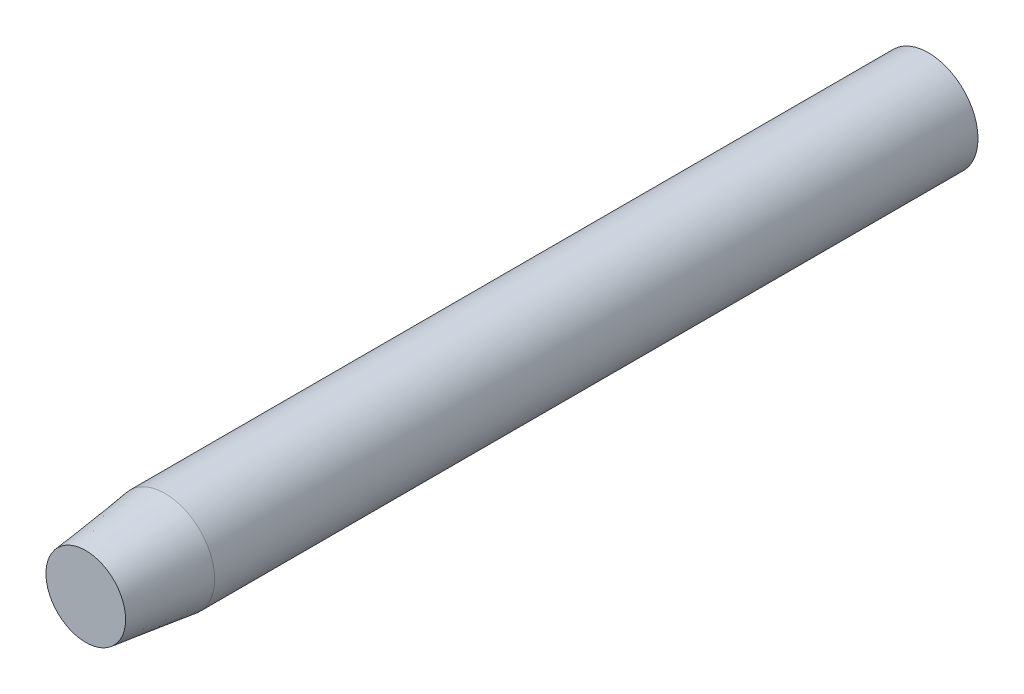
from build123d import *

# Parameters (mm, degrees)
SKETCH1_R           = 6.35
BOSS_EXTRUDE1_DEPTH = 107.95
CHAMFER1_SIZE       = 10.16
CHAMFER1_SIZE2      = 1.247491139


with BuildPart() as part:
    # Sketch1 → Boss-Extrude1 (new body)
    with BuildSketch(Plane.XY):
        Circle(SKETCH1_R)
    extrude(amount=BOSS_EXTRUDE1_DEPTH)

    # Chamfer1
    chamfer1_edges = [part.edges().sort_by_distance(p)[0] for p in [
        (-6.35, 0, 107.95),
    ]]
    chamfer1_side = [part.faces().sort_by_distance(p)[0] for p in [
        (-6.35, 0, 53.975),
    ]]
    chamfer(chamfer1_edges, length=CHAMFER1_SIZE, length2=CHAMFER1_SIZE2, reference=chamfer1_side[0])


solid = part.part
